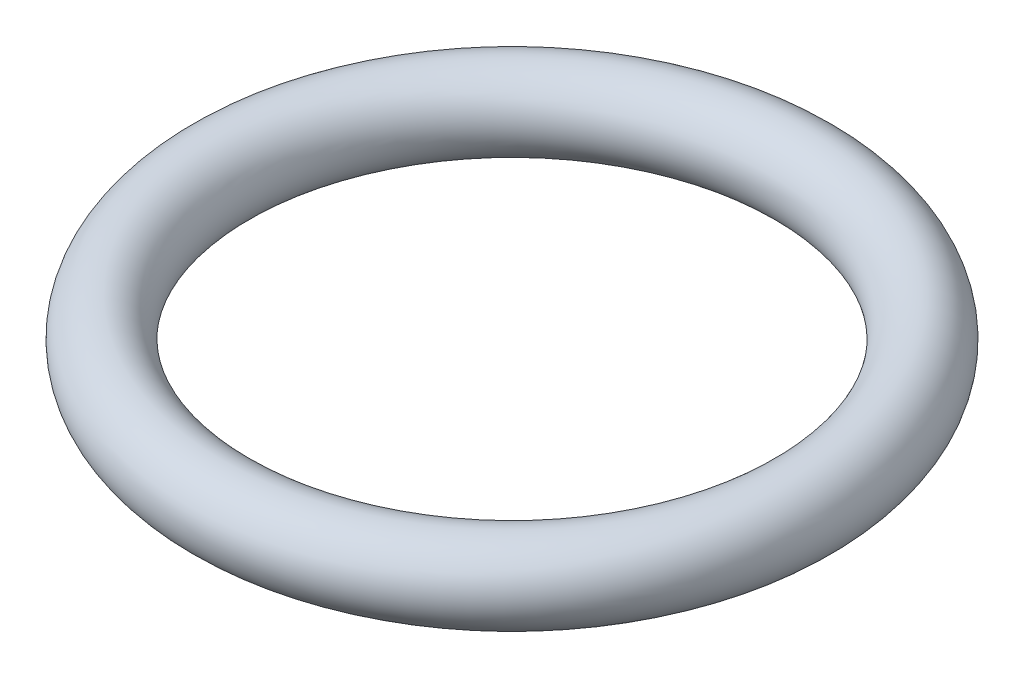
ISO-10303-21;
HEADER;
FILE_DESCRIPTION(('STEP AP214'),'2;1');
FILE_NAME('part.step','',(''),(''),'','','');
FILE_SCHEMA(('AUTOMOTIVE_DESIGN { 1 0 10303 214 1 1 1 1 }'));
ENDSEC;
DATA;
#1=APPLICATION_CONTEXT('core data for automotive mechanical design processes');
#2=APPLICATION_PROTOCOL_DEFINITION('international standard','automotive_design',2000,#1);
#3=PRODUCT_CONTEXT('',#1,'mechanical');
#4=PRODUCT('Part','Part','',(#3));
#5=PRODUCT_RELATED_PRODUCT_CATEGORY('part','',(#4));
#6=PRODUCT_DEFINITION_FORMATION('','',#4);
#7=PRODUCT_DEFINITION_CONTEXT('part definition',#1,'design');
#8=PRODUCT_DEFINITION('design','',#6,#7);
#9=PRODUCT_DEFINITION_SHAPE('','',#8);
#10=(LENGTH_UNIT() NAMED_UNIT(*) SI_UNIT(.MILLI.,.METRE.));
#11=(NAMED_UNIT(*) PLANE_ANGLE_UNIT() SI_UNIT($,.RADIAN.));
#12=(NAMED_UNIT(*) SI_UNIT($,.STERADIAN.) SOLID_ANGLE_UNIT());
#13=UNCERTAINTY_MEASURE_WITH_UNIT(LENGTH_MEASURE(1.E-05),#10,'distance_accuracy_value','');
#14=(GEOMETRIC_REPRESENTATION_CONTEXT(3) GLOBAL_UNCERTAINTY_ASSIGNED_CONTEXT((#13)) GLOBAL_UNIT_ASSIGNED_CONTEXT((#10,
#11,#12)) REPRESENTATION_CONTEXT('',''));
#15=CARTESIAN_POINT('',(0.,0.,0.));
#16=DIRECTION('',(0.,0.,1.));
#17=DIRECTION('',(1.,0.,0.));
#18=AXIS2_PLACEMENT_3D('',#15,#16,#17);
#19=CARTESIAN_POINT('',(0.,0.,0.));
#20=DIRECTION('',(0.,-1.,0.));
#21=DIRECTION('',(0.,0.,-1.));
#22=AXIS2_PLACEMENT_3D('',#19,#20,#21);
#23=TOROIDAL_SURFACE('',#22,5.55,0.749999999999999);
#24=CARTESIAN_POINT('',(0.,0.,-6.3));
#25=VERTEX_POINT('',#24);
#26=VERTEX_LOOP('',#25);
#27=FACE_BOUND('',#26,.T.);
#28=ADVANCED_FACE('F33',(#27),#23,.T.);
#29=CLOSED_SHELL('',(#28));
#30=MANIFOLD_SOLID_BREP('B2',#29);
#31=ADVANCED_BREP_SHAPE_REPRESENTATION('',(#18,#30),#14);
#32=SHAPE_DEFINITION_REPRESENTATION(#9,#31);
ENDSEC;
END-ISO-10303-21;
